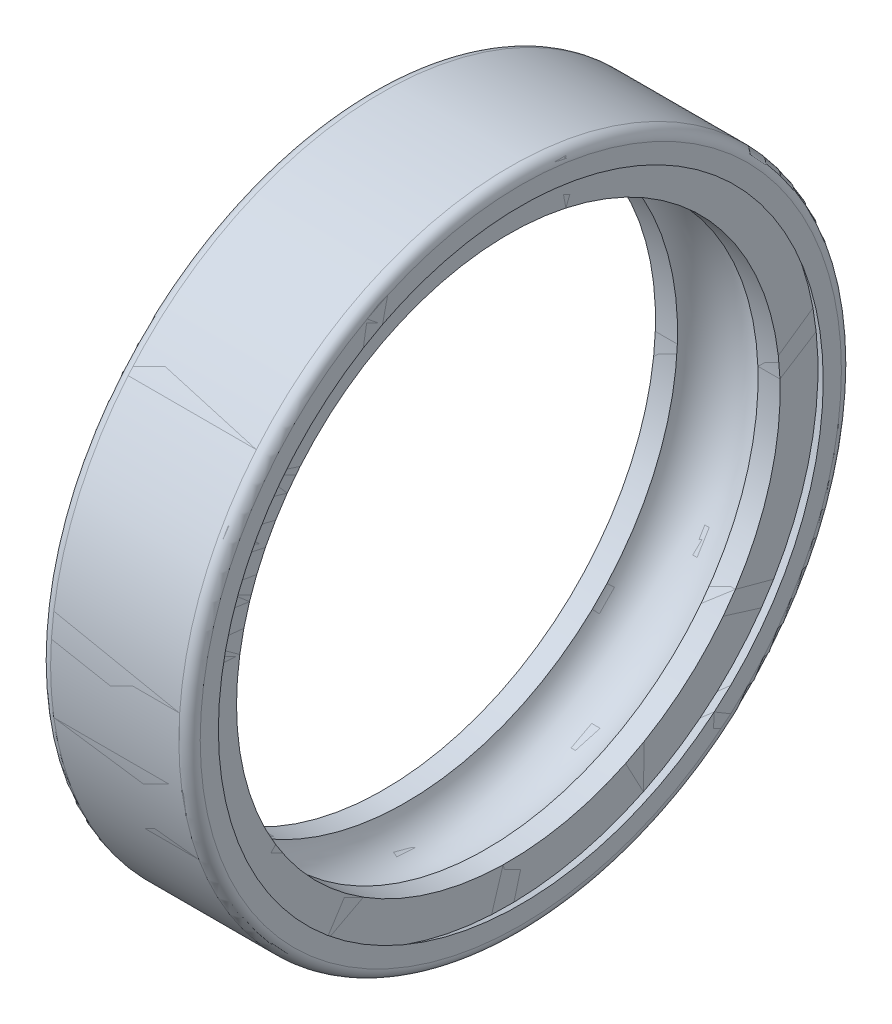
ISO-10303-21;
HEADER;
FILE_DESCRIPTION(('STEP AP214'),'2;1');
FILE_NAME('part.step','',(''),(''),'','','');
FILE_SCHEMA(('AUTOMOTIVE_DESIGN { 1 0 10303 214 1 1 1 1 }'));
ENDSEC;
DATA;
#1=APPLICATION_CONTEXT('core data for automotive mechanical design processes');
#2=APPLICATION_PROTOCOL_DEFINITION('international standard','automotive_design',2000,#1);
#3=PRODUCT_CONTEXT('',#1,'mechanical');
#4=PRODUCT('Part','Part','',(#3));
#5=PRODUCT_RELATED_PRODUCT_CATEGORY('part','',(#4));
#6=PRODUCT_DEFINITION_FORMATION('','',#4);
#7=PRODUCT_DEFINITION_CONTEXT('part definition',#1,'design');
#8=PRODUCT_DEFINITION('design','',#6,#7);
#9=PRODUCT_DEFINITION_SHAPE('','',#8);
#10=(LENGTH_UNIT() NAMED_UNIT(*) SI_UNIT(.MILLI.,.METRE.));
#11=(NAMED_UNIT(*) PLANE_ANGLE_UNIT() SI_UNIT($,.RADIAN.));
#12=(NAMED_UNIT(*) SI_UNIT($,.STERADIAN.) SOLID_ANGLE_UNIT());
#13=UNCERTAINTY_MEASURE_WITH_UNIT(LENGTH_MEASURE(1.E-05),#10,'distance_accuracy_value','');
#14=(GEOMETRIC_REPRESENTATION_CONTEXT(3) GLOBAL_UNCERTAINTY_ASSIGNED_CONTEXT((#13)) GLOBAL_UNIT_ASSIGNED_CONTEXT((#10,
#11,#12)) REPRESENTATION_CONTEXT('',''));
#15=CARTESIAN_POINT('',(0.,0.,0.));
#16=DIRECTION('',(0.,0.,1.));
#17=DIRECTION('',(1.,0.,0.));
#18=AXIS2_PLACEMENT_3D('',#15,#16,#17);
#19=CARTESIAN_POINT('',(0.,0.,0.));
#20=DIRECTION('',(-1.,0.,0.));
#21=DIRECTION('',(0.,0.,1.));
#22=AXIS2_PLACEMENT_3D('',#19,#20,#21);
#23=CYLINDRICAL_SURFACE('',#22,25.435);
#24=CARTESIAN_POINT('',(12.8333333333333,0.,0.));
#25=DIRECTION('',(-1.,0.,0.));
#26=DIRECTION('',(0.,0.,1.));
#27=AXIS2_PLACEMENT_3D('',#24,#25,#26);
#28=CIRCLE('',#27,25.435);
#29=CARTESIAN_POINT('',(12.8333333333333,0.,25.435));
#30=VERTEX_POINT('',#29);
#31=EDGE_CURVE('P0_E10',#30,#30,#28,.T.);
#32=ORIENTED_EDGE('',*,*,#31,.F.);
#33=EDGE_LOOP('',(#32));
#34=FACE_BOUND('',#33,.T.);
#35=CARTESIAN_POINT('',(10.7680598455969,0.,0.));
#36=DIRECTION('',(-1.,0.,0.));
#37=DIRECTION('',(0.,0.,1.));
#38=AXIS2_PLACEMENT_3D('',#35,#36,#37);
#39=CIRCLE('',#38,25.435);
#40=CARTESIAN_POINT('',(10.7680598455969,0.,25.435));
#41=VERTEX_POINT('',#40);
#42=EDGE_CURVE('P0_E67',#41,#41,#39,.T.);
#43=ORIENTED_EDGE('',*,*,#42,.T.);
#44=EDGE_LOOP('',(#43));
#45=FACE_BOUND('',#44,.T.);
#46=ADVANCED_FACE('P0_F26',(#34,#45),#23,.F.);
#47=CARTESIAN_POINT('',(12.8333333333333,25.435,0.));
#48=DIRECTION('',(-1.,0.,0.));
#49=DIRECTION('',(0.,0.,1.));
#50=AXIS2_PLACEMENT_3D('',#47,#48,#49);
#51=PLANE('',#50);
#52=CARTESIAN_POINT('',(12.8333333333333,0.,0.));
#53=DIRECTION('',(-1.,0.,0.));
#54=DIRECTION('',(0.,0.,1.));
#55=AXIS2_PLACEMENT_3D('',#52,#53,#54);
#56=CIRCLE('',#55,28.9735755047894);
#57=CARTESIAN_POINT('',(12.8333333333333,0.,28.9735755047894));
#58=VERTEX_POINT('',#57);
#59=EDGE_CURVE('P0_E32',#58,#58,#56,.T.);
#60=ORIENTED_EDGE('',*,*,#59,.F.);
#61=EDGE_LOOP('',(#60));
#62=FACE_BOUND('',#61,.T.);
#63=ORIENTED_EDGE('',*,*,#31,.T.);
#64=EDGE_LOOP('',(#63));
#65=FACE_BOUND('',#64,.T.);
#66=ADVANCED_FACE('P0_F84',(#62,#65),#51,.F.);
#67=CARTESIAN_POINT('',(12.8333333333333,0.,0.));
#68=DIRECTION('',(-1.,0.,0.));
#69=DIRECTION('',(0.,0.,1.));
#70=AXIS2_PLACEMENT_3D('',#67,#68,#69);
#71=CONICAL_SURFACE('',#70,28.9735755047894,0.523598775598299);
#72=CARTESIAN_POINT('',(14.,0.,0.));
#73=DIRECTION('',(-1.,0.,0.));
#74=DIRECTION('',(0.,0.,1.));
#75=AXIS2_PLACEMENT_3D('',#72,#73,#74);
#76=CIRCLE('',#75,28.3000001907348);
#77=CARTESIAN_POINT('',(14.,0.,28.3000001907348));
#78=VERTEX_POINT('',#77);
#79=EDGE_CURVE('P0_E36',#78,#78,#76,.T.);
#80=ORIENTED_EDGE('',*,*,#79,.F.);
#81=EDGE_LOOP('',(#80));
#82=FACE_BOUND('',#81,.T.);
#83=ORIENTED_EDGE('',*,*,#59,.T.);
#84=EDGE_LOOP('',(#83));
#85=FACE_BOUND('',#84,.T.);
#86=ADVANCED_FACE('P0_F89',(#82,#85),#71,.F.);
#87=CARTESIAN_POINT('',(14.,28.3000001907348,0.));
#88=DIRECTION('',(-1.,0.,0.));
#89=DIRECTION('',(0.,0.,1.));
#90=AXIS2_PLACEMENT_3D('',#87,#88,#89);
#91=PLANE('',#90);
#92=CARTESIAN_POINT('',(14.,0.,0.));
#93=DIRECTION('',(-1.,0.,0.));
#94=DIRECTION('',(0.,0.,1.));
#95=AXIS2_PLACEMENT_3D('',#92,#93,#94);
#96=CIRCLE('',#95,30.);
#97=CARTESIAN_POINT('',(14.,0.,30.));
#98=VERTEX_POINT('',#97);
#99=EDGE_CURVE('P0_E41',#98,#98,#96,.T.);
#100=ORIENTED_EDGE('',*,*,#99,.F.);
#101=EDGE_LOOP('',(#100));
#102=FACE_BOUND('',#101,.T.);
#103=ORIENTED_EDGE('',*,*,#79,.T.);
#104=EDGE_LOOP('',(#103));
#105=FACE_BOUND('',#104,.T.);
#106=ADVANCED_FACE('P0_F94',(#102,#105),#91,.F.);
#107=CARTESIAN_POINT('',(13.,0.,0.));
#108=DIRECTION('',(-1.,0.,0.));
#109=DIRECTION('',(0.,0.,1.));
#110=AXIS2_PLACEMENT_3D('',#107,#108,#109);
#111=TOROIDAL_SURFACE('',#110,30.,1.);
#112=CARTESIAN_POINT('',(13.,0.,0.));
#113=DIRECTION('',(-1.,0.,0.));
#114=DIRECTION('',(0.,0.,1.));
#115=AXIS2_PLACEMENT_3D('',#112,#113,#114);
#116=CIRCLE('',#115,31.);
#117=CARTESIAN_POINT('',(13.,0.,31.));
#118=VERTEX_POINT('',#117);
#119=EDGE_CURVE('P0_E46',#118,#118,#116,.T.);
#120=ORIENTED_EDGE('',*,*,#119,.F.);
#121=EDGE_LOOP('',(#120));
#122=FACE_BOUND('',#121,.T.);
#123=ORIENTED_EDGE('',*,*,#99,.T.);
#124=EDGE_LOOP('',(#123));
#125=FACE_BOUND('',#124,.T.);
#126=ADVANCED_FACE('P0_F100',(#122,#125),#111,.T.);
#127=CARTESIAN_POINT('',(0.,0.,0.));
#128=DIRECTION('',(-1.,0.,0.));
#129=DIRECTION('',(0.,0.,1.));
#130=AXIS2_PLACEMENT_3D('',#127,#128,#129);
#131=CYLINDRICAL_SURFACE('',#130,31.);
#132=CARTESIAN_POINT('',(1.,0.,0.));
#133=DIRECTION('',(-1.,0.,0.));
#134=DIRECTION('',(0.,0.,1.));
#135=AXIS2_PLACEMENT_3D('',#132,#133,#134);
#136=CIRCLE('',#135,31.);
#137=CARTESIAN_POINT('',(1.,0.,31.));
#138=VERTEX_POINT('',#137);
#139=EDGE_CURVE('P0_E49',#138,#138,#136,.T.);
#140=ORIENTED_EDGE('',*,*,#139,.F.);
#141=EDGE_LOOP('',(#140));
#142=FACE_BOUND('',#141,.T.);
#143=ORIENTED_EDGE('',*,*,#119,.T.);
#144=EDGE_LOOP('',(#143));
#145=FACE_BOUND('',#144,.T.);
#146=ADVANCED_FACE('P0_F104',(#142,#145),#131,.T.);
#147=CARTESIAN_POINT('',(1.,0.,0.));
#148=DIRECTION('',(-1.,0.,0.));
#149=DIRECTION('',(0.,0.,1.));
#150=AXIS2_PLACEMENT_3D('',#147,#148,#149);
#151=TOROIDAL_SURFACE('',#150,30.,1.);
#152=CARTESIAN_POINT('',(0.,0.,0.));
#153=DIRECTION('',(-1.,0.,0.));
#154=DIRECTION('',(0.,0.,1.));
#155=AXIS2_PLACEMENT_3D('',#152,#153,#154);
#156=CIRCLE('',#155,30.);
#157=CARTESIAN_POINT('',(0.,0.,30.));
#158=VERTEX_POINT('',#157);
#159=EDGE_CURVE('P0_E52',#158,#158,#156,.T.);
#160=ORIENTED_EDGE('',*,*,#159,.F.);
#161=EDGE_LOOP('',(#160));
#162=FACE_BOUND('',#161,.T.);
#163=ORIENTED_EDGE('',*,*,#139,.T.);
#164=EDGE_LOOP('',(#163));
#165=FACE_BOUND('',#164,.T.);
#166=ADVANCED_FACE('P0_F108',(#162,#165),#151,.T.);
#167=CARTESIAN_POINT('',(0.,30.,0.));
#168=DIRECTION('',(1.,0.,0.));
#169=DIRECTION('',(0.,0.,-1.));
#170=AXIS2_PLACEMENT_3D('',#167,#168,#169);
#171=PLANE('',#170);
#172=CARTESIAN_POINT('',(0.,0.,0.));
#173=DIRECTION('',(-1.,0.,0.));
#174=DIRECTION('',(0.,0.,1.));
#175=AXIS2_PLACEMENT_3D('',#172,#173,#174);
#176=CIRCLE('',#175,28.3000001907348);
#177=CARTESIAN_POINT('',(0.,0.,28.3000001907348));
#178=VERTEX_POINT('',#177);
#179=EDGE_CURVE('P0_E55',#178,#178,#176,.T.);
#180=ORIENTED_EDGE('',*,*,#179,.F.);
#181=EDGE_LOOP('',(#180));
#182=FACE_BOUND('',#181,.T.);
#183=ORIENTED_EDGE('',*,*,#159,.T.);
#184=EDGE_LOOP('',(#183));
#185=FACE_BOUND('',#184,.T.);
#186=ADVANCED_FACE('P0_F112',(#182,#185),#171,.F.);
#187=CARTESIAN_POINT('',(0.,0.,0.));
#188=DIRECTION('',(1.,0.,0.));
#189=DIRECTION('',(0.,0.,-1.));
#190=AXIS2_PLACEMENT_3D('',#187,#188,#189);
#191=CONICAL_SURFACE('',#190,28.3000001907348,0.523598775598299);
#192=CARTESIAN_POINT('',(1.16666666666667,0.,0.));
#193=DIRECTION('',(-1.,0.,0.));
#194=DIRECTION('',(0.,0.,1.));
#195=AXIS2_PLACEMENT_3D('',#192,#193,#194);
#196=CIRCLE('',#195,28.9735755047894);
#197=CARTESIAN_POINT('',(1.16666666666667,0.,28.9735755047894));
#198=VERTEX_POINT('',#197);
#199=EDGE_CURVE('P0_E58',#198,#198,#196,.T.);
#200=ORIENTED_EDGE('',*,*,#199,.F.);
#201=EDGE_LOOP('',(#200));
#202=FACE_BOUND('',#201,.T.);
#203=ORIENTED_EDGE('',*,*,#179,.T.);
#204=EDGE_LOOP('',(#203));
#205=FACE_BOUND('',#204,.T.);
#206=ADVANCED_FACE('P0_F116',(#202,#205),#191,.F.);
#207=CARTESIAN_POINT('',(1.16666666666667,28.9735755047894,0.));
#208=DIRECTION('',(1.,0.,0.));
#209=DIRECTION('',(0.,0.,-1.));
#210=AXIS2_PLACEMENT_3D('',#207,#208,#209);
#211=PLANE('',#210);
#212=CARTESIAN_POINT('',(1.16666666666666,0.,0.));
#213=DIRECTION('',(-1.,0.,0.));
#214=DIRECTION('',(0.,0.,1.));
#215=AXIS2_PLACEMENT_3D('',#212,#213,#214);
#216=CIRCLE('',#215,25.435);
#217=CARTESIAN_POINT('',(1.16666666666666,0.,25.435));
#218=VERTEX_POINT('',#217);
#219=EDGE_CURVE('P0_E61',#218,#218,#216,.T.);
#220=ORIENTED_EDGE('',*,*,#219,.F.);
#221=EDGE_LOOP('',(#220));
#222=FACE_BOUND('',#221,.T.);
#223=ORIENTED_EDGE('',*,*,#199,.T.);
#224=EDGE_LOOP('',(#223));
#225=FACE_BOUND('',#224,.T.);
#226=ADVANCED_FACE('P0_F80',(#222,#225),#211,.F.);
#227=CARTESIAN_POINT('',(0.,0.,0.));
#228=DIRECTION('',(-1.,0.,0.));
#229=DIRECTION('',(0.,0.,1.));
#230=AXIS2_PLACEMENT_3D('',#227,#228,#229);
#231=CYLINDRICAL_SURFACE('',#230,25.435);
#232=CARTESIAN_POINT('',(3.23194015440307,0.,0.));
#233=DIRECTION('',(-1.,0.,0.));
#234=DIRECTION('',(0.,0.,1.));
#235=AXIS2_PLACEMENT_3D('',#232,#233,#234);
#236=CIRCLE('',#235,25.435);
#237=CARTESIAN_POINT('',(3.23194015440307,0.,25.435));
#238=VERTEX_POINT('',#237);
#239=EDGE_CURVE('P0_E64',#238,#238,#236,.T.);
#240=ORIENTED_EDGE('',*,*,#239,.F.);
#241=EDGE_LOOP('',(#240));
#242=FACE_BOUND('',#241,.T.);
#243=ORIENTED_EDGE('',*,*,#219,.T.);
#244=EDGE_LOOP('',(#243));
#245=FACE_BOUND('',#244,.T.);
#246=ADVANCED_FACE('P0_F74',(#242,#245),#231,.F.);
#247=CARTESIAN_POINT('',(7.,0.,0.));
#248=DIRECTION('',(-1.,0.,0.));
#249=DIRECTION('',(0.,0.,1.));
#250=AXIS2_PLACEMENT_3D('',#247,#248,#249);
#251=TOROIDAL_SURFACE('',#250,24.25,3.95);
#252=ORIENTED_EDGE('',*,*,#239,.T.);
#253=EDGE_LOOP('',(#252));
#254=FACE_BOUND('',#253,.T.);
#255=ORIENTED_EDGE('',*,*,#42,.F.);
#256=EDGE_LOOP('',(#255));
#257=FACE_BOUND('',#256,.T.);
#258=ADVANCED_FACE('P0_F72',(#254,#257),#251,.F.);
#259=CLOSED_SHELL('',(#46,#66,#86,#106,#126,#146,#166,#186,#206,#226,#246,#258));
#260=MANIFOLD_SOLID_BREP('P0_B2',#259);
#261=CARTESIAN_POINT('',(0.,0.,0.));
#262=DIRECTION('',(-1.,0.,0.));
#263=DIRECTION('',(0.,0.,1.));
#264=AXIS2_PLACEMENT_3D('',#261,#262,#263);
#265=CYLINDRICAL_SURFACE('',#264,25.435);
#266=CARTESIAN_POINT('',(12.8333333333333,0.,0.));
#267=DIRECTION('',(-1.,0.,0.));
#268=DIRECTION('',(0.,0.,1.));
#269=AXIS2_PLACEMENT_3D('',#266,#267,#268);
#270=CIRCLE('',#269,25.435);
#271=CARTESIAN_POINT('',(12.8333333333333,0.,25.435));
#272=VERTEX_POINT('',#271);
#273=EDGE_CURVE('P1_E10',#272,#272,#270,.T.);
#274=ORIENTED_EDGE('',*,*,#273,.F.);
#275=EDGE_LOOP('',(#274));
#276=FACE_BOUND('',#275,.T.);
#277=CARTESIAN_POINT('',(10.7680598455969,0.,0.));
#278=DIRECTION('',(-1.,0.,0.));
#279=DIRECTION('',(0.,0.,1.));
#280=AXIS2_PLACEMENT_3D('',#277,#278,#279);
#281=CIRCLE('',#280,25.435);
#282=CARTESIAN_POINT('',(10.7680598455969,0.,25.435));
#283=VERTEX_POINT('',#282);
#284=EDGE_CURVE('P1_E54',#283,#283,#281,.T.);
#285=ORIENTED_EDGE('',*,*,#284,.T.);
#286=EDGE_LOOP('',(#285));
#287=FACE_BOUND('',#286,.T.);
#288=ADVANCED_FACE('P1_F14',(#276,#287),#265,.F.);
#289=CARTESIAN_POINT('',(12.8333333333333,25.435,0.));
#290=DIRECTION('',(-1.,0.,0.));
#291=DIRECTION('',(0.,0.,1.));
#292=AXIS2_PLACEMENT_3D('',#289,#290,#291);
#293=PLANE('',#292);
#294=CARTESIAN_POINT('',(12.8333333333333,0.,0.));
#295=DIRECTION('',(-1.,0.,0.));
#296=DIRECTION('',(0.,0.,1.));
#297=AXIS2_PLACEMENT_3D('',#294,#295,#296);
#298=CIRCLE('',#297,28.9735755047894);
#299=CARTESIAN_POINT('',(12.8333333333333,0.,28.9735755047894));
#300=VERTEX_POINT('',#299);
#301=EDGE_CURVE('P1_E20',#300,#300,#298,.T.);
#302=ORIENTED_EDGE('',*,*,#301,.F.);
#303=EDGE_LOOP('',(#302));
#304=FACE_BOUND('',#303,.T.);
#305=ORIENTED_EDGE('',*,*,#273,.T.);
#306=EDGE_LOOP('',(#305));
#307=FACE_BOUND('',#306,.T.);
#308=ADVANCED_FACE('P1_F72',(#304,#307),#293,.F.);
#309=CARTESIAN_POINT('',(12.8333333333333,0.,0.));
#310=DIRECTION('',(-1.,0.,0.));
#311=DIRECTION('',(0.,0.,1.));
#312=AXIS2_PLACEMENT_3D('',#309,#310,#311);
#313=CONICAL_SURFACE('',#312,28.9735755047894,0.523598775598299);
#314=CARTESIAN_POINT('',(14.,0.,0.));
#315=DIRECTION('',(-1.,0.,0.));
#316=DIRECTION('',(0.,0.,1.));
#317=AXIS2_PLACEMENT_3D('',#314,#315,#316);
#318=CIRCLE('',#317,28.3000001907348);
#319=CARTESIAN_POINT('',(14.,0.,28.3000001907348));
#320=VERTEX_POINT('',#319);
#321=EDGE_CURVE('P1_E24',#320,#320,#318,.T.);
#322=ORIENTED_EDGE('',*,*,#321,.F.);
#323=EDGE_LOOP('',(#322));
#324=FACE_BOUND('',#323,.T.);
#325=ORIENTED_EDGE('',*,*,#301,.T.);
#326=EDGE_LOOP('',(#325));
#327=FACE_BOUND('',#326,.T.);
#328=ADVANCED_FACE('P1_F77',(#324,#327),#313,.F.);
#329=CARTESIAN_POINT('',(14.,28.3000001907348,0.));
#330=DIRECTION('',(-1.,0.,0.));
#331=DIRECTION('',(0.,0.,1.));
#332=AXIS2_PLACEMENT_3D('',#329,#330,#331);
#333=PLANE('',#332);
#334=CARTESIAN_POINT('',(14.,0.,0.));
#335=DIRECTION('',(-1.,0.,0.));
#336=DIRECTION('',(0.,0.,1.));
#337=AXIS2_PLACEMENT_3D('',#334,#335,#336);
#338=CIRCLE('',#337,30.);
#339=CARTESIAN_POINT('',(14.,0.,30.));
#340=VERTEX_POINT('',#339);
#341=EDGE_CURVE('P1_E28',#340,#340,#338,.T.);
#342=ORIENTED_EDGE('',*,*,#341,.F.);
#343=EDGE_LOOP('',(#342));
#344=FACE_BOUND('',#343,.T.);
#345=ORIENTED_EDGE('',*,*,#321,.T.);
#346=EDGE_LOOP('',(#345));
#347=FACE_BOUND('',#346,.T.);
#348=ADVANCED_FACE('P1_F82',(#344,#347),#333,.F.);
#349=CARTESIAN_POINT('',(13.,0.,0.));
#350=DIRECTION('',(-1.,0.,0.));
#351=DIRECTION('',(0.,0.,1.));
#352=AXIS2_PLACEMENT_3D('',#349,#350,#351);
#353=TOROIDAL_SURFACE('',#352,30.,1.);
#354=CARTESIAN_POINT('',(13.,0.,0.));
#355=DIRECTION('',(-1.,0.,0.));
#356=DIRECTION('',(0.,0.,1.));
#357=AXIS2_PLACEMENT_3D('',#354,#355,#356);
#358=CIRCLE('',#357,31.);
#359=CARTESIAN_POINT('',(13.,0.,31.));
#360=VERTEX_POINT('',#359);
#361=EDGE_CURVE('P1_E33',#360,#360,#358,.T.);
#362=ORIENTED_EDGE('',*,*,#361,.F.);
#363=EDGE_LOOP('',(#362));
#364=FACE_BOUND('',#363,.T.);
#365=ORIENTED_EDGE('',*,*,#341,.T.);
#366=EDGE_LOOP('',(#365));
#367=FACE_BOUND('',#366,.T.);
#368=ADVANCED_FACE('P1_F88',(#364,#367),#353,.T.);
#369=CARTESIAN_POINT('',(0.,0.,0.));
#370=DIRECTION('',(-1.,0.,0.));
#371=DIRECTION('',(0.,0.,1.));
#372=AXIS2_PLACEMENT_3D('',#369,#370,#371);
#373=CYLINDRICAL_SURFACE('',#372,31.);
#374=CARTESIAN_POINT('',(1.,0.,0.));
#375=DIRECTION('',(-1.,0.,0.));
#376=DIRECTION('',(0.,0.,1.));
#377=AXIS2_PLACEMENT_3D('',#374,#375,#376);
#378=CIRCLE('',#377,31.);
#379=CARTESIAN_POINT('',(1.,0.,31.));
#380=VERTEX_POINT('',#379);
#381=EDGE_CURVE('P1_E36',#380,#380,#378,.T.);
#382=ORIENTED_EDGE('',*,*,#381,.F.);
#383=EDGE_LOOP('',(#382));
#384=FACE_BOUND('',#383,.T.);
#385=ORIENTED_EDGE('',*,*,#361,.T.);
#386=EDGE_LOOP('',(#385));
#387=FACE_BOUND('',#386,.T.);
#388=ADVANCED_FACE('P1_F92',(#384,#387),#373,.T.);
#389=CARTESIAN_POINT('',(1.,0.,0.));
#390=DIRECTION('',(-1.,0.,0.));
#391=DIRECTION('',(0.,0.,1.));
#392=AXIS2_PLACEMENT_3D('',#389,#390,#391);
#393=TOROIDAL_SURFACE('',#392,30.,1.);
#394=CARTESIAN_POINT('',(0.,0.,0.));
#395=DIRECTION('',(-1.,0.,0.));
#396=DIRECTION('',(0.,0.,1.));
#397=AXIS2_PLACEMENT_3D('',#394,#395,#396);
#398=CIRCLE('',#397,30.);
#399=CARTESIAN_POINT('',(0.,0.,30.));
#400=VERTEX_POINT('',#399);
#401=EDGE_CURVE('P1_E39',#400,#400,#398,.T.);
#402=ORIENTED_EDGE('',*,*,#401,.F.);
#403=EDGE_LOOP('',(#402));
#404=FACE_BOUND('',#403,.T.);
#405=ORIENTED_EDGE('',*,*,#381,.T.);
#406=EDGE_LOOP('',(#405));
#407=FACE_BOUND('',#406,.T.);
#408=ADVANCED_FACE('P1_F96',(#404,#407),#393,.T.);
#409=CARTESIAN_POINT('',(0.,30.,0.));
#410=DIRECTION('',(1.,0.,0.));
#411=DIRECTION('',(0.,0.,-1.));
#412=AXIS2_PLACEMENT_3D('',#409,#410,#411);
#413=PLANE('',#412);
#414=CARTESIAN_POINT('',(0.,0.,0.));
#415=DIRECTION('',(-1.,0.,0.));
#416=DIRECTION('',(0.,0.,1.));
#417=AXIS2_PLACEMENT_3D('',#414,#415,#416);
#418=CIRCLE('',#417,28.3000001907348);
#419=CARTESIAN_POINT('',(0.,0.,28.3000001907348));
#420=VERTEX_POINT('',#419);
#421=EDGE_CURVE('P1_E42',#420,#420,#418,.T.);
#422=ORIENTED_EDGE('',*,*,#421,.F.);
#423=EDGE_LOOP('',(#422));
#424=FACE_BOUND('',#423,.T.);
#425=ORIENTED_EDGE('',*,*,#401,.T.);
#426=EDGE_LOOP('',(#425));
#427=FACE_BOUND('',#426,.T.);
#428=ADVANCED_FACE('P1_F100',(#424,#427),#413,.F.);
#429=CARTESIAN_POINT('',(0.,0.,0.));
#430=DIRECTION('',(1.,0.,0.));
#431=DIRECTION('',(0.,0.,-1.));
#432=AXIS2_PLACEMENT_3D('',#429,#430,#431);
#433=CONICAL_SURFACE('',#432,28.3000001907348,0.523598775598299);
#434=CARTESIAN_POINT('',(1.16666666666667,0.,0.));
#435=DIRECTION('',(-1.,0.,0.));
#436=DIRECTION('',(0.,0.,1.));
#437=AXIS2_PLACEMENT_3D('',#434,#435,#436);
#438=CIRCLE('',#437,28.9735755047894);
#439=CARTESIAN_POINT('',(1.16666666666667,0.,28.9735755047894));
#440=VERTEX_POINT('',#439);
#441=EDGE_CURVE('P1_E45',#440,#440,#438,.T.);
#442=ORIENTED_EDGE('',*,*,#441,.F.);
#443=EDGE_LOOP('',(#442));
#444=FACE_BOUND('',#443,.T.);
#445=ORIENTED_EDGE('',*,*,#421,.T.);
#446=EDGE_LOOP('',(#445));
#447=FACE_BOUND('',#446,.T.);
#448=ADVANCED_FACE('P1_F104',(#444,#447),#433,.F.);
#449=CARTESIAN_POINT('',(1.16666666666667,28.9735755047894,0.));
#450=DIRECTION('',(1.,0.,0.));
#451=DIRECTION('',(0.,0.,-1.));
#452=AXIS2_PLACEMENT_3D('',#449,#450,#451);
#453=PLANE('',#452);
#454=CARTESIAN_POINT('',(1.16666666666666,0.,0.));
#455=DIRECTION('',(-1.,0.,0.));
#456=DIRECTION('',(0.,0.,1.));
#457=AXIS2_PLACEMENT_3D('',#454,#455,#456);
#458=CIRCLE('',#457,25.435);
#459=CARTESIAN_POINT('',(1.16666666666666,0.,25.435));
#460=VERTEX_POINT('',#459);
#461=EDGE_CURVE('P1_E48',#460,#460,#458,.T.);
#462=ORIENTED_EDGE('',*,*,#461,.F.);
#463=EDGE_LOOP('',(#462));
#464=FACE_BOUND('',#463,.T.);
#465=ORIENTED_EDGE('',*,*,#441,.T.);
#466=EDGE_LOOP('',(#465));
#467=FACE_BOUND('',#466,.T.);
#468=ADVANCED_FACE('P1_F68',(#464,#467),#453,.F.);
#469=CARTESIAN_POINT('',(0.,0.,0.));
#470=DIRECTION('',(-1.,0.,0.));
#471=DIRECTION('',(0.,0.,1.));
#472=AXIS2_PLACEMENT_3D('',#469,#470,#471);
#473=CYLINDRICAL_SURFACE('',#472,25.435);
#474=CARTESIAN_POINT('',(3.23194015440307,0.,0.));
#475=DIRECTION('',(-1.,0.,0.));
#476=DIRECTION('',(0.,0.,1.));
#477=AXIS2_PLACEMENT_3D('',#474,#475,#476);
#478=CIRCLE('',#477,25.435);
#479=CARTESIAN_POINT('',(3.23194015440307,0.,25.435));
#480=VERTEX_POINT('',#479);
#481=EDGE_CURVE('P1_E51',#480,#480,#478,.T.);
#482=ORIENTED_EDGE('',*,*,#481,.F.);
#483=EDGE_LOOP('',(#482));
#484=FACE_BOUND('',#483,.T.);
#485=ORIENTED_EDGE('',*,*,#461,.T.);
#486=EDGE_LOOP('',(#485));
#487=FACE_BOUND('',#486,.T.);
#488=ADVANCED_FACE('P1_F61',(#484,#487),#473,.F.);
#489=CARTESIAN_POINT('',(7.,0.,0.));
#490=DIRECTION('',(-1.,0.,0.));
#491=DIRECTION('',(0.,0.,1.));
#492=AXIS2_PLACEMENT_3D('',#489,#490,#491);
#493=TOROIDAL_SURFACE('',#492,24.25,3.95);
#494=ORIENTED_EDGE('',*,*,#481,.T.);
#495=EDGE_LOOP('',(#494));
#496=FACE_BOUND('',#495,.T.);
#497=ORIENTED_EDGE('',*,*,#284,.F.);
#498=EDGE_LOOP('',(#497));
#499=FACE_BOUND('',#498,.T.);
#500=ADVANCED_FACE('P1_F59',(#496,#499),#493,.F.);
#501=CLOSED_SHELL('',(#288,#308,#328,#348,#368,#388,#408,#428,#448,#468,#488,#500));
#502=MANIFOLD_SOLID_BREP('P1_B1',#501);
#503=ADVANCED_BREP_SHAPE_REPRESENTATION('',(#18,#260,#502),#14);
#504=SHAPE_DEFINITION_REPRESENTATION(#9,#503);
ENDSEC;
END-ISO-10303-21;
